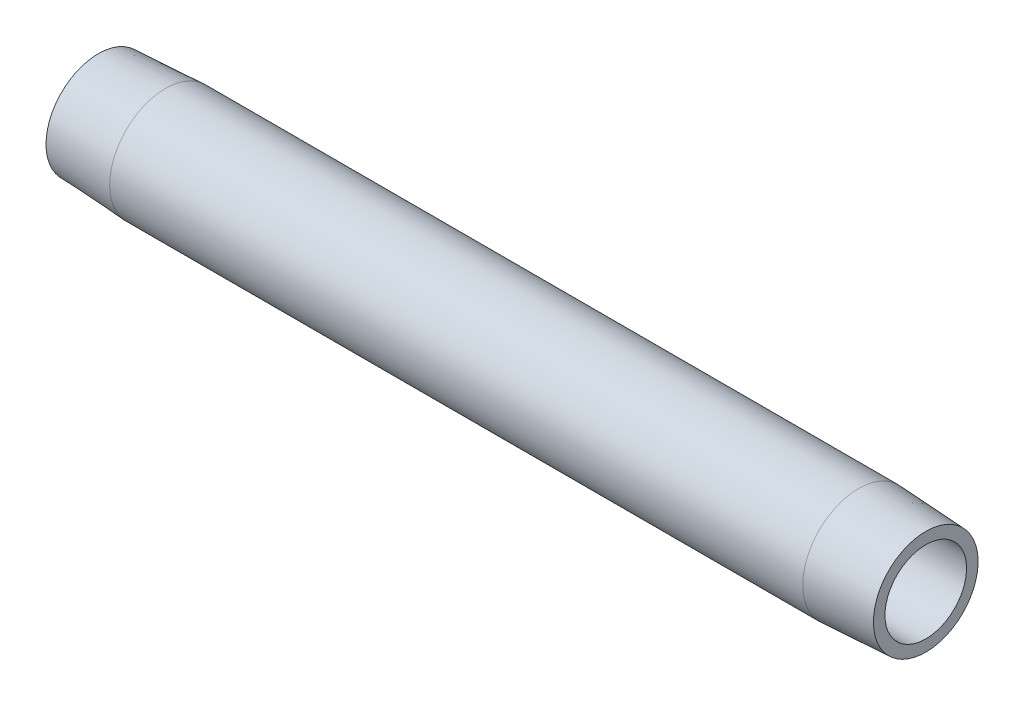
from build123d import *


with BuildPart() as part:
    # Sketch1 → Revolve1 (revolve)
    with BuildSketch(Plane.XY, mode=Mode.PRIVATE) as revolve1_sk:
        Polygon((127, 6.2611), (0, 6.2611), (0, 8.032050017), (10.3124, 8.5725), (116.6876, 8.5725), (127, 8.032050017), align=None)
    revolve(revolve1_sk.sketch.rotate(Axis((0, 0, 0), (1, 0, 0)), 90), axis=Axis((0, 0, 0), (1, 0, 0)))


solid = part.part
